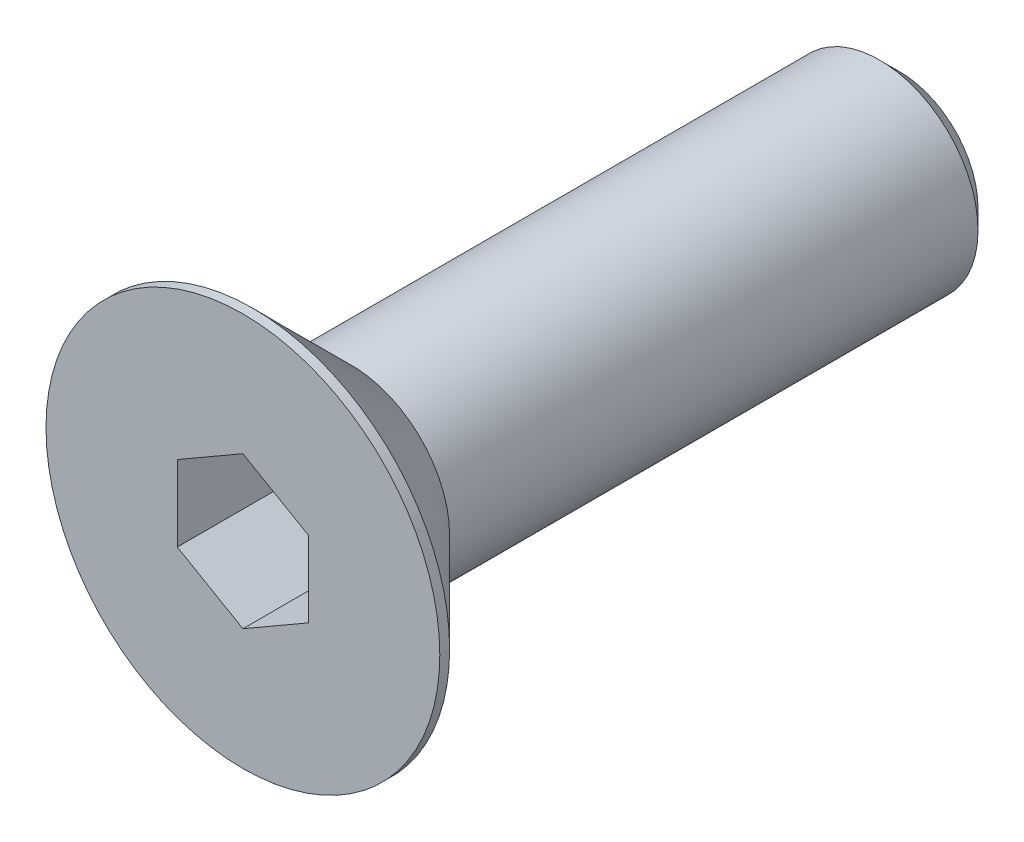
from build123d import *

# Parameters (mm, degrees)
FASE1_SIZE                      = 0.6
SCHNITT_LINEAR_AUSTRAGEN1_DEPTH = 3


with BuildPart() as part:
    # Skizze1 → Basis-Rotation (revolve)
    with BuildSketch(Plane(origin=(0, 0, 0), x_dir=(0, 0, -1), z_dir=(1, 0, 0)), mode=Mode.PRIVATE) as basis_rotation_sk:
        Polygon((20, 0), (20, 3), (3.3, 3), (0.3, 6), (0, 6), (0, 0), align=None)
    revolve(basis_rotation_sk.sketch.rotate(Axis((0, 0, 0), (0, 0, -1)), 90), axis=Axis((0, 0, 0), (0, 0, -1)))

    # Fase1
    fase1_edges = [part.edges().sort_by_distance(p)[0] for p in [
        (-3, 0, -20),
    ]]
    chamfer(fase1_edges, length=FASE1_SIZE)

    # Skizze2 → Schnitt-Linear austragen1 (cut)
    with BuildSketch(Plane.XY):
        Polygon((2, -1.154700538), (2, 1.154700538), (0, 2.309401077), (-2, 1.154700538), (-2, -1.154700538), (0, -2.309401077), align=None)
    extrude(amount=-SCHNITT_LINEAR_AUSTRAGEN1_DEPTH, mode=Mode.SUBTRACT)


solid = part.part
